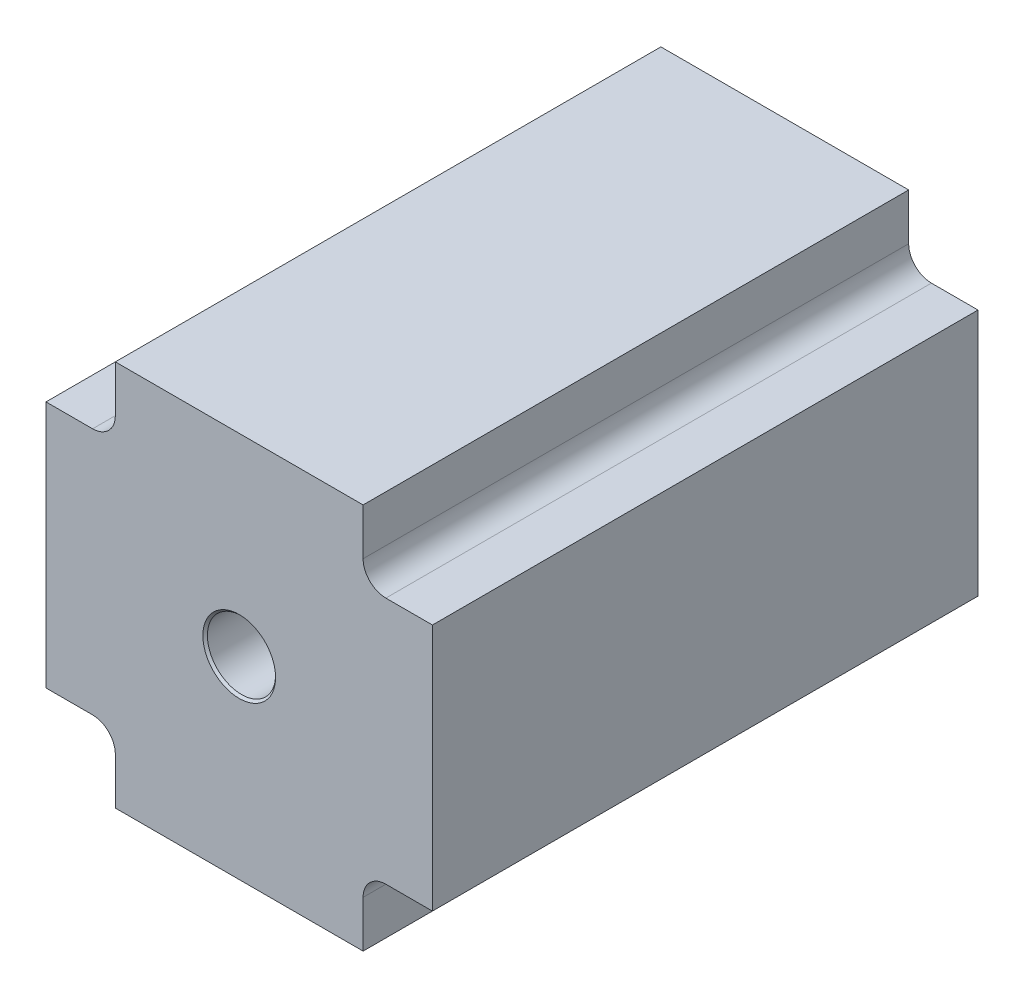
ISO-10303-21;
HEADER;
FILE_DESCRIPTION(('STEP AP214'),'2;1');
FILE_NAME('part.step','',(''),(''),'','','');
FILE_SCHEMA(('AUTOMOTIVE_DESIGN { 1 0 10303 214 1 1 1 1 }'));
ENDSEC;
DATA;
#1=APPLICATION_CONTEXT('core data for automotive mechanical design processes');
#2=APPLICATION_PROTOCOL_DEFINITION('international standard','automotive_design',2000,#1);
#3=PRODUCT_CONTEXT('',#1,'mechanical');
#4=PRODUCT('Part','Part','',(#3));
#5=PRODUCT_RELATED_PRODUCT_CATEGORY('part','',(#4));
#6=PRODUCT_DEFINITION_FORMATION('','',#4);
#7=PRODUCT_DEFINITION_CONTEXT('part definition',#1,'design');
#8=PRODUCT_DEFINITION('design','',#6,#7);
#9=PRODUCT_DEFINITION_SHAPE('','',#8);
#10=(LENGTH_UNIT() NAMED_UNIT(*) SI_UNIT(.MILLI.,.METRE.));
#11=(NAMED_UNIT(*) PLANE_ANGLE_UNIT() SI_UNIT($,.RADIAN.));
#12=(NAMED_UNIT(*) SI_UNIT($,.STERADIAN.) SOLID_ANGLE_UNIT());
#13=UNCERTAINTY_MEASURE_WITH_UNIT(LENGTH_MEASURE(1.E-05),#10,'distance_accuracy_value','');
#14=(GEOMETRIC_REPRESENTATION_CONTEXT(3) GLOBAL_UNCERTAINTY_ASSIGNED_CONTEXT((#13)) GLOBAL_UNIT_ASSIGNED_CONTEXT((#10,
#11,#12)) REPRESENTATION_CONTEXT('',''));
#15=CARTESIAN_POINT('',(0.,0.,0.));
#16=DIRECTION('',(0.,0.,1.));
#17=DIRECTION('',(1.,0.,0.));
#18=AXIS2_PLACEMENT_3D('',#15,#16,#17);
#19=CARTESIAN_POINT('',(-27.25,-27.25,120.));
#20=DIRECTION('',(1.,0.,0.));
#21=DIRECTION('',(0.,1.,0.));
#22=AXIS2_PLACEMENT_3D('',#19,#20,#21);
#23=PLANE('',#22);
#24=DIRECTION('',(0.,-1.,0.));
#25=VECTOR('',#24,1.);
#26=CARTESIAN_POINT('',(-27.25,-27.25,120.));
#27=LINE('',#26,#25);
#28=CARTESIAN_POINT('',(-27.25,-32.25,120.));
#29=VERTEX_POINT('',#28);
#30=CARTESIAN_POINT('',(-27.25,-42.5,120.));
#31=VERTEX_POINT('',#30);
#32=EDGE_CURVE('E149',#29,#31,#27,.T.);
#33=ORIENTED_EDGE('',*,*,#32,.F.);
#34=DIRECTION('',(0.,0.,-1.));
#35=VECTOR('',#34,1.);
#36=CARTESIAN_POINT('',(-27.25,-32.25,0.));
#37=LINE('',#36,#35);
#38=CARTESIAN_POINT('',(-27.25,-32.25,0.));
#39=VERTEX_POINT('',#38);
#40=EDGE_CURVE('E193',#29,#39,#37,.T.);
#41=ORIENTED_EDGE('',*,*,#40,.T.);
#42=DIRECTION('',(0.,-1.,0.));
#43=VECTOR('',#42,1.);
#44=CARTESIAN_POINT('',(-27.25,-27.25,0.));
#45=LINE('',#44,#43);
#46=CARTESIAN_POINT('',(-27.25,-42.5,0.));
#47=VERTEX_POINT('',#46);
#48=EDGE_CURVE('E174',#39,#47,#45,.T.);
#49=ORIENTED_EDGE('',*,*,#48,.T.);
#50=DIRECTION('',(0.,0.,-1.));
#51=VECTOR('',#50,1.);
#52=CARTESIAN_POINT('',(-27.25,-42.5,120.));
#53=LINE('',#52,#51);
#54=EDGE_CURVE('E167',#31,#47,#53,.T.);
#55=ORIENTED_EDGE('',*,*,#54,.F.);
#56=EDGE_LOOP('',(#33,#41,#49,#55));
#57=FACE_BOUND('',#56,.T.);
#58=ADVANCED_FACE('F37',(#57),#23,.F.);
#59=CARTESIAN_POINT('',(27.25,-42.5,120.));
#60=DIRECTION('',(0.,1.,0.));
#61=DIRECTION('',(-1.,0.,0.));
#62=AXIS2_PLACEMENT_3D('',#59,#60,#61);
#63=PLANE('',#62);
#64=DIRECTION('',(1.,0.,0.));
#65=VECTOR('',#64,1.);
#66=CARTESIAN_POINT('',(27.25,-42.5,0.));
#67=LINE('',#66,#65);
#68=CARTESIAN_POINT('',(27.25,-42.5,0.));
#69=VERTEX_POINT('',#68);
#70=EDGE_CURVE('E292',#47,#69,#67,.T.);
#71=ORIENTED_EDGE('',*,*,#70,.T.);
#72=DIRECTION('',(0.,0.,-1.));
#73=VECTOR('',#72,1.);
#74=CARTESIAN_POINT('',(27.25,-42.5,120.));
#75=LINE('',#74,#73);
#76=CARTESIAN_POINT('',(27.25,-42.5,120.));
#77=VERTEX_POINT('',#76);
#78=EDGE_CURVE('E169',#77,#69,#75,.T.);
#79=ORIENTED_EDGE('',*,*,#78,.F.);
#80=DIRECTION('',(1.,0.,0.));
#81=VECTOR('',#80,1.);
#82=CARTESIAN_POINT('',(27.25,-42.5,120.));
#83=LINE('',#82,#81);
#84=EDGE_CURVE('E154',#31,#77,#83,.T.);
#85=ORIENTED_EDGE('',*,*,#84,.F.);
#86=ORIENTED_EDGE('',*,*,#54,.T.);
#87=EDGE_LOOP('',(#71,#79,#85,#86));
#88=FACE_BOUND('',#87,.T.);
#89=ADVANCED_FACE('F166',(#88),#63,.F.);
#90=CARTESIAN_POINT('',(27.25,-27.25,120.));
#91=DIRECTION('',(-1.,0.,0.));
#92=DIRECTION('',(0.,0.,1.));
#93=AXIS2_PLACEMENT_3D('',#90,#91,#92);
#94=PLANE('',#93);
#95=DIRECTION('',(0.,1.,0.));
#96=VECTOR('',#95,1.);
#97=CARTESIAN_POINT('',(27.25,-27.25,0.));
#98=LINE('',#97,#96);
#99=CARTESIAN_POINT('',(27.25,-32.25,0.));
#100=VERTEX_POINT('',#99);
#101=EDGE_CURVE('E291',#69,#100,#98,.T.);
#102=ORIENTED_EDGE('',*,*,#101,.T.);
#103=DIRECTION('',(0.,0.,-1.));
#104=VECTOR('',#103,1.);
#105=CARTESIAN_POINT('',(27.25,-32.25,120.));
#106=LINE('',#105,#104);
#107=CARTESIAN_POINT('',(27.25,-32.25,120.));
#108=VERTEX_POINT('',#107);
#109=EDGE_CURVE('E200',#100,#108,#106,.F.);
#110=ORIENTED_EDGE('',*,*,#109,.T.);
#111=DIRECTION('',(0.,1.,0.));
#112=VECTOR('',#111,1.);
#113=CARTESIAN_POINT('',(27.25,-27.25,120.));
#114=LINE('',#113,#112);
#115=EDGE_CURVE('E171',#77,#108,#114,.T.);
#116=ORIENTED_EDGE('',*,*,#115,.F.);
#117=ORIENTED_EDGE('',*,*,#78,.T.);
#118=EDGE_LOOP('',(#102,#110,#116,#117));
#119=FACE_BOUND('',#118,.T.);
#120=ADVANCED_FACE('F317',(#119),#94,.F.);
#121=CARTESIAN_POINT('',(42.5,-27.25,120.));
#122=DIRECTION('',(0.,1.,0.));
#123=DIRECTION('',(0.,0.,1.));
#124=AXIS2_PLACEMENT_3D('',#121,#122,#123);
#125=PLANE('',#124);
#126=DIRECTION('',(1.,0.,0.));
#127=VECTOR('',#126,1.);
#128=CARTESIAN_POINT('',(42.5,-27.25,120.));
#129=LINE('',#128,#127);
#130=CARTESIAN_POINT('',(32.25,-27.25,120.));
#131=VERTEX_POINT('',#130);
#132=CARTESIAN_POINT('',(42.5,-27.25,120.));
#133=VERTEX_POINT('',#132);
#134=EDGE_CURVE('E307',#131,#133,#129,.T.);
#135=ORIENTED_EDGE('',*,*,#134,.F.);
#136=DIRECTION('',(0.,0.,-1.));
#137=VECTOR('',#136,1.);
#138=CARTESIAN_POINT('',(32.25,-27.25,0.));
#139=LINE('',#138,#137);
#140=CARTESIAN_POINT('',(32.25,-27.25,0.));
#141=VERTEX_POINT('',#140);
#142=EDGE_CURVE('E197',#131,#141,#139,.T.);
#143=ORIENTED_EDGE('',*,*,#142,.T.);
#144=DIRECTION('',(1.,0.,0.));
#145=VECTOR('',#144,1.);
#146=CARTESIAN_POINT('',(42.5,-27.25,0.));
#147=LINE('',#146,#145);
#148=CARTESIAN_POINT('',(42.5,-27.25,0.));
#149=VERTEX_POINT('',#148);
#150=EDGE_CURVE('E256',#141,#149,#147,.T.);
#151=ORIENTED_EDGE('',*,*,#150,.T.);
#152=DIRECTION('',(0.,0.,-1.));
#153=VECTOR('',#152,1.);
#154=CARTESIAN_POINT('',(42.5,-27.25,120.));
#155=LINE('',#154,#153);
#156=EDGE_CURVE('E181',#133,#149,#155,.T.);
#157=ORIENTED_EDGE('',*,*,#156,.F.);
#158=EDGE_LOOP('',(#135,#143,#151,#157));
#159=FACE_BOUND('',#158,.T.);
#160=ADVANCED_FACE('F315',(#159),#125,.F.);
#161=CARTESIAN_POINT('',(42.5,-27.25,120.));
#162=DIRECTION('',(-1.,0.,0.));
#163=DIRECTION('',(0.,0.,1.));
#164=AXIS2_PLACEMENT_3D('',#161,#162,#163);
#165=PLANE('',#164);
#166=DIRECTION('',(0.,1.,0.));
#167=VECTOR('',#166,1.);
#168=CARTESIAN_POINT('',(42.5,-27.25,0.));
#169=LINE('',#168,#167);
#170=CARTESIAN_POINT('',(42.5,27.25,0.));
#171=VERTEX_POINT('',#170);
#172=EDGE_CURVE('E252',#149,#171,#169,.T.);
#173=ORIENTED_EDGE('',*,*,#172,.T.);
#174=DIRECTION('',(0.,0.,-1.));
#175=VECTOR('',#174,1.);
#176=CARTESIAN_POINT('',(42.5,27.25,120.));
#177=LINE('',#176,#175);
#178=CARTESIAN_POINT('',(42.5,27.25,120.));
#179=VERTEX_POINT('',#178);
#180=EDGE_CURVE('E251',#179,#171,#177,.T.);
#181=ORIENTED_EDGE('',*,*,#180,.F.);
#182=DIRECTION('',(0.,1.,0.));
#183=VECTOR('',#182,1.);
#184=CARTESIAN_POINT('',(42.5,-27.25,120.));
#185=LINE('',#184,#183);
#186=EDGE_CURVE('E285',#133,#179,#185,.T.);
#187=ORIENTED_EDGE('',*,*,#186,.F.);
#188=ORIENTED_EDGE('',*,*,#156,.T.);
#189=EDGE_LOOP('',(#173,#181,#187,#188));
#190=FACE_BOUND('',#189,.T.);
#191=ADVANCED_FACE('F284',(#190),#165,.F.);
#192=CARTESIAN_POINT('',(42.5,27.25,120.));
#193=DIRECTION('',(0.,-1.,0.));
#194=DIRECTION('',(1.,0.,0.));
#195=AXIS2_PLACEMENT_3D('',#192,#193,#194);
#196=PLANE('',#195);
#197=DIRECTION('',(-1.,0.,0.));
#198=VECTOR('',#197,1.);
#199=CARTESIAN_POINT('',(42.5,27.25,0.));
#200=LINE('',#199,#198);
#201=CARTESIAN_POINT('',(32.25,27.25,0.));
#202=VERTEX_POINT('',#201);
#203=EDGE_CURVE('E244',#171,#202,#200,.T.);
#204=ORIENTED_EDGE('',*,*,#203,.T.);
#205=DIRECTION('',(0.,0.,-1.));
#206=VECTOR('',#205,1.);
#207=CARTESIAN_POINT('',(32.25,27.25,120.));
#208=LINE('',#207,#206);
#209=CARTESIAN_POINT('',(32.25,27.25,120.));
#210=VERTEX_POINT('',#209);
#211=EDGE_CURVE('E205',#202,#210,#208,.F.);
#212=ORIENTED_EDGE('',*,*,#211,.T.);
#213=DIRECTION('',(-1.,0.,0.));
#214=VECTOR('',#213,1.);
#215=CARTESIAN_POINT('',(42.5,27.25,120.));
#216=LINE('',#215,#214);
#217=EDGE_CURVE('E227',#179,#210,#216,.T.);
#218=ORIENTED_EDGE('',*,*,#217,.F.);
#219=ORIENTED_EDGE('',*,*,#180,.T.);
#220=EDGE_LOOP('',(#204,#212,#218,#219));
#221=FACE_BOUND('',#220,.T.);
#222=ADVANCED_FACE('F249',(#221),#196,.F.);
#223=CARTESIAN_POINT('',(27.25,42.5,120.));
#224=DIRECTION('',(-1.,0.,0.));
#225=DIRECTION('',(0.,-1.,0.));
#226=AXIS2_PLACEMENT_3D('',#223,#224,#225);
#227=PLANE('',#226);
#228=DIRECTION('',(0.,1.,0.));
#229=VECTOR('',#228,1.);
#230=CARTESIAN_POINT('',(27.25,42.5,120.));
#231=LINE('',#230,#229);
#232=CARTESIAN_POINT('',(27.25,32.25,120.));
#233=VERTEX_POINT('',#232);
#234=CARTESIAN_POINT('',(27.25,42.5,120.));
#235=VERTEX_POINT('',#234);
#236=EDGE_CURVE('E224',#233,#235,#231,.T.);
#237=ORIENTED_EDGE('',*,*,#236,.F.);
#238=DIRECTION('',(0.,0.,-1.));
#239=VECTOR('',#238,1.);
#240=CARTESIAN_POINT('',(27.25,32.25,0.));
#241=LINE('',#240,#239);
#242=CARTESIAN_POINT('',(27.25,32.25,0.));
#243=VERTEX_POINT('',#242);
#244=EDGE_CURVE('E202',#233,#243,#241,.T.);
#245=ORIENTED_EDGE('',*,*,#244,.T.);
#246=DIRECTION('',(0.,1.,0.));
#247=VECTOR('',#246,1.);
#248=CARTESIAN_POINT('',(27.25,42.5,0.));
#249=LINE('',#248,#247);
#250=CARTESIAN_POINT('',(27.25,42.5,0.));
#251=VERTEX_POINT('',#250);
#252=EDGE_CURVE('E246',#243,#251,#249,.T.);
#253=ORIENTED_EDGE('',*,*,#252,.T.);
#254=DIRECTION('',(0.,0.,-1.));
#255=VECTOR('',#254,1.);
#256=CARTESIAN_POINT('',(27.25,42.5,120.));
#257=LINE('',#256,#255);
#258=EDGE_CURVE('E235',#235,#251,#257,.T.);
#259=ORIENTED_EDGE('',*,*,#258,.F.);
#260=EDGE_LOOP('',(#237,#245,#253,#259));
#261=FACE_BOUND('',#260,.T.);
#262=ADVANCED_FACE('F232',(#261),#227,.F.);
#263=CARTESIAN_POINT('',(27.25,42.5,120.));
#264=DIRECTION('',(0.,-1.,0.));
#265=DIRECTION('',(1.,0.,0.));
#266=AXIS2_PLACEMENT_3D('',#263,#264,#265);
#267=PLANE('',#266);
#268=DIRECTION('',(-1.,0.,0.));
#269=VECTOR('',#268,1.);
#270=CARTESIAN_POINT('',(27.25,42.5,0.));
#271=LINE('',#270,#269);
#272=CARTESIAN_POINT('',(-27.25,42.5,0.));
#273=VERTEX_POINT('',#272);
#274=EDGE_CURVE('E254',#251,#273,#271,.T.);
#275=ORIENTED_EDGE('',*,*,#274,.T.);
#276=DIRECTION('',(0.,0.,-1.));
#277=VECTOR('',#276,1.);
#278=CARTESIAN_POINT('',(-27.25,42.5,120.));
#279=LINE('',#278,#277);
#280=CARTESIAN_POINT('',(-27.25,42.5,120.));
#281=VERTEX_POINT('',#280);
#282=EDGE_CURVE('E276',#281,#273,#279,.T.);
#283=ORIENTED_EDGE('',*,*,#282,.F.);
#284=DIRECTION('',(-1.,0.,0.));
#285=VECTOR('',#284,1.);
#286=CARTESIAN_POINT('',(27.25,42.5,120.));
#287=LINE('',#286,#285);
#288=EDGE_CURVE('E237',#235,#281,#287,.T.);
#289=ORIENTED_EDGE('',*,*,#288,.F.);
#290=ORIENTED_EDGE('',*,*,#258,.T.);
#291=EDGE_LOOP('',(#275,#283,#289,#290));
#292=FACE_BOUND('',#291,.T.);
#293=ADVANCED_FACE('F385',(#292),#267,.F.);
#294=CARTESIAN_POINT('',(-27.25,42.5,120.));
#295=DIRECTION('',(1.,0.,0.));
#296=DIRECTION('',(0.,0.,-1.));
#297=AXIS2_PLACEMENT_3D('',#294,#295,#296);
#298=PLANE('',#297);
#299=DIRECTION('',(0.,-1.,0.));
#300=VECTOR('',#299,1.);
#301=CARTESIAN_POINT('',(-27.25,42.5,0.));
#302=LINE('',#301,#300);
#303=CARTESIAN_POINT('',(-27.25,32.25,0.));
#304=VERTEX_POINT('',#303);
#305=EDGE_CURVE('E261',#273,#304,#302,.T.);
#306=ORIENTED_EDGE('',*,*,#305,.T.);
#307=DIRECTION('',(0.,0.,-1.));
#308=VECTOR('',#307,1.);
#309=CARTESIAN_POINT('',(-27.25,32.25,120.));
#310=LINE('',#309,#308);
#311=CARTESIAN_POINT('',(-27.25,32.25,120.));
#312=VERTEX_POINT('',#311);
#313=EDGE_CURVE('E52',#304,#312,#310,.F.);
#314=ORIENTED_EDGE('',*,*,#313,.T.);
#315=DIRECTION('',(0.,-1.,0.));
#316=VECTOR('',#315,1.);
#317=CARTESIAN_POINT('',(-27.25,42.5,120.));
#318=LINE('',#317,#316);
#319=EDGE_CURVE('E302',#281,#312,#318,.T.);
#320=ORIENTED_EDGE('',*,*,#319,.F.);
#321=ORIENTED_EDGE('',*,*,#282,.T.);
#322=EDGE_LOOP('',(#306,#314,#320,#321));
#323=FACE_BOUND('',#322,.T.);
#324=ADVANCED_FACE('F382',(#323),#298,.F.);
#325=CARTESIAN_POINT('',(-27.25,27.25,120.));
#326=DIRECTION('',(0.,-1.,0.));
#327=DIRECTION('',(0.,0.,-1.));
#328=AXIS2_PLACEMENT_3D('',#325,#326,#327);
#329=PLANE('',#328);
#330=DIRECTION('',(-1.,0.,0.));
#331=VECTOR('',#330,1.);
#332=CARTESIAN_POINT('',(-27.25,27.25,120.));
#333=LINE('',#332,#331);
#334=CARTESIAN_POINT('',(-32.25,27.25,120.));
#335=VERTEX_POINT('',#334);
#336=CARTESIAN_POINT('',(-42.5,27.25,120.));
#337=VERTEX_POINT('',#336);
#338=EDGE_CURVE('E300',#335,#337,#333,.T.);
#339=ORIENTED_EDGE('',*,*,#338,.F.);
#340=DIRECTION('',(0.,0.,-1.));
#341=VECTOR('',#340,1.);
#342=CARTESIAN_POINT('',(-32.25,27.25,0.));
#343=LINE('',#342,#341);
#344=CARTESIAN_POINT('',(-32.25,27.25,0.));
#345=VERTEX_POINT('',#344);
#346=EDGE_CURVE('E207',#335,#345,#343,.T.);
#347=ORIENTED_EDGE('',*,*,#346,.T.);
#348=DIRECTION('',(-1.,0.,0.));
#349=VECTOR('',#348,1.);
#350=CARTESIAN_POINT('',(-27.25,27.25,0.));
#351=LINE('',#350,#349);
#352=CARTESIAN_POINT('',(-42.5,27.25,0.));
#353=VERTEX_POINT('',#352);
#354=EDGE_CURVE('E263',#345,#353,#351,.T.);
#355=ORIENTED_EDGE('',*,*,#354,.T.);
#356=DIRECTION('',(0.,0.,-1.));
#357=VECTOR('',#356,1.);
#358=CARTESIAN_POINT('',(-42.5,27.25,120.));
#359=LINE('',#358,#357);
#360=EDGE_CURVE('E272',#337,#353,#359,.T.);
#361=ORIENTED_EDGE('',*,*,#360,.F.);
#362=EDGE_LOOP('',(#339,#347,#355,#361));
#363=FACE_BOUND('',#362,.T.);
#364=ADVANCED_FACE('F358',(#363),#329,.F.);
#365=CARTESIAN_POINT('',(-42.5,-27.25,120.));
#366=DIRECTION('',(1.,0.,0.));
#367=DIRECTION('',(0.,0.,-1.));
#368=AXIS2_PLACEMENT_3D('',#365,#366,#367);
#369=PLANE('',#368);
#370=DIRECTION('',(0.,-1.,0.));
#371=VECTOR('',#370,1.);
#372=CARTESIAN_POINT('',(-42.5,-27.25,0.));
#373=LINE('',#372,#371);
#374=CARTESIAN_POINT('',(-42.5,-27.25,0.));
#375=VERTEX_POINT('',#374);
#376=EDGE_CURVE('E265',#353,#375,#373,.T.);
#377=ORIENTED_EDGE('',*,*,#376,.T.);
#378=DIRECTION('',(0.,0.,-1.));
#379=VECTOR('',#378,1.);
#380=CARTESIAN_POINT('',(-42.5,-27.25,120.));
#381=LINE('',#380,#379);
#382=CARTESIAN_POINT('',(-42.5,-27.25,120.));
#383=VERTEX_POINT('',#382);
#384=EDGE_CURVE('E269',#383,#375,#381,.T.);
#385=ORIENTED_EDGE('',*,*,#384,.F.);
#386=DIRECTION('',(0.,-1.,0.));
#387=VECTOR('',#386,1.);
#388=CARTESIAN_POINT('',(-42.5,-27.25,120.));
#389=LINE('',#388,#387);
#390=EDGE_CURVE('E298',#337,#383,#389,.T.);
#391=ORIENTED_EDGE('',*,*,#390,.F.);
#392=ORIENTED_EDGE('',*,*,#360,.T.);
#393=EDGE_LOOP('',(#377,#385,#391,#392));
#394=FACE_BOUND('',#393,.T.);
#395=ADVANCED_FACE('F363',(#394),#369,.F.);
#396=CARTESIAN_POINT('',(-27.25,-27.25,120.));
#397=DIRECTION('',(0.,1.,0.));
#398=DIRECTION('',(-1.,0.,0.));
#399=AXIS2_PLACEMENT_3D('',#396,#397,#398);
#400=PLANE('',#399);
#401=DIRECTION('',(1.,0.,0.));
#402=VECTOR('',#401,1.);
#403=CARTESIAN_POINT('',(-27.25,-27.25,0.));
#404=LINE('',#403,#402);
#405=CARTESIAN_POINT('',(-32.25,-27.25,0.));
#406=VERTEX_POINT('',#405);
#407=EDGE_CURVE('E162',#375,#406,#404,.T.);
#408=ORIENTED_EDGE('',*,*,#407,.T.);
#409=DIRECTION('',(0.,0.,-1.));
#410=VECTOR('',#409,1.);
#411=CARTESIAN_POINT('',(-32.25,-27.25,120.));
#412=LINE('',#411,#410);
#413=CARTESIAN_POINT('',(-32.25,-27.25,120.));
#414=VERTEX_POINT('',#413);
#415=EDGE_CURVE('E195',#406,#414,#412,.F.);
#416=ORIENTED_EDGE('',*,*,#415,.T.);
#417=DIRECTION('',(1.,0.,0.));
#418=VECTOR('',#417,1.);
#419=CARTESIAN_POINT('',(-27.25,-27.25,120.));
#420=LINE('',#419,#418);
#421=EDGE_CURVE('E273',#383,#414,#420,.T.);
#422=ORIENTED_EDGE('',*,*,#421,.F.);
#423=ORIENTED_EDGE('',*,*,#384,.T.);
#424=EDGE_LOOP('',(#408,#416,#422,#423));
#425=FACE_BOUND('',#424,.T.);
#426=ADVANCED_FACE('F368',(#425),#400,.F.);
#427=CARTESIAN_POINT('',(0.,0.,120.));
#428=DIRECTION('',(0.,0.,-1.));
#429=DIRECTION('',(-1.,0.,0.));
#430=AXIS2_PLACEMENT_3D('',#427,#428,#429);
#431=PLANE('',#430);
#432=CARTESIAN_POINT('',(0.,0.,120.));
#433=DIRECTION('',(0.,0.,-1.));
#434=DIRECTION('',(-1.,0.,0.));
#435=AXIS2_PLACEMENT_3D('',#432,#433,#434);
#436=CIRCLE('',#435,8.00000000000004);
#437=CARTESIAN_POINT('',(-8.00000000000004,0.,120.));
#438=VERTEX_POINT('',#437);
#439=EDGE_CURVE('E190',#438,#438,#436,.T.);
#440=ORIENTED_EDGE('',*,*,#439,.T.);
#441=EDGE_LOOP('',(#440));
#442=FACE_BOUND('',#441,.T.);
#443=ORIENTED_EDGE('',*,*,#421,.T.);
#444=CARTESIAN_POINT('',(-32.25,-32.25,120.));
#445=DIRECTION('',(0.,0.,-1.));
#446=DIRECTION('',(-1.,0.,0.));
#447=AXIS2_PLACEMENT_3D('',#444,#445,#446);
#448=CIRCLE('',#447,5.);
#449=EDGE_CURVE('E157',#414,#29,#448,.T.);
#450=ORIENTED_EDGE('',*,*,#449,.T.);
#451=ORIENTED_EDGE('',*,*,#32,.T.);
#452=ORIENTED_EDGE('',*,*,#84,.T.);
#453=ORIENTED_EDGE('',*,*,#115,.T.);
#454=CARTESIAN_POINT('',(32.25,-32.25,120.));
#455=DIRECTION('',(0.,0.,-1.));
#456=DIRECTION('',(-1.,0.,0.));
#457=AXIS2_PLACEMENT_3D('',#454,#455,#456);
#458=CIRCLE('',#457,5.);
#459=EDGE_CURVE('E216',#108,#131,#458,.T.);
#460=ORIENTED_EDGE('',*,*,#459,.T.);
#461=ORIENTED_EDGE('',*,*,#134,.T.);
#462=ORIENTED_EDGE('',*,*,#186,.T.);
#463=ORIENTED_EDGE('',*,*,#217,.T.);
#464=CARTESIAN_POINT('',(32.25,32.25,120.));
#465=DIRECTION('',(0.,0.,-1.));
#466=DIRECTION('',(-1.,0.,0.));
#467=AXIS2_PLACEMENT_3D('',#464,#465,#466);
#468=CIRCLE('',#467,5.);
#469=EDGE_CURVE('E220',#210,#233,#468,.T.);
#470=ORIENTED_EDGE('',*,*,#469,.T.);
#471=ORIENTED_EDGE('',*,*,#236,.T.);
#472=ORIENTED_EDGE('',*,*,#288,.T.);
#473=ORIENTED_EDGE('',*,*,#319,.T.);
#474=CARTESIAN_POINT('',(-32.25,32.25,120.));
#475=DIRECTION('',(0.,0.,-1.));
#476=DIRECTION('',(-1.,0.,0.));
#477=AXIS2_PLACEMENT_3D('',#474,#475,#476);
#478=CIRCLE('',#477,5.);
#479=EDGE_CURVE('E11',#312,#335,#478,.T.);
#480=ORIENTED_EDGE('',*,*,#479,.T.);
#481=ORIENTED_EDGE('',*,*,#338,.T.);
#482=ORIENTED_EDGE('',*,*,#390,.T.);
#483=EDGE_LOOP('',(#443,#450,#451,#452,#453,#460,#461,#462,#463,#470,#471,#472,#473,#480,#481,#482));
#484=FACE_BOUND('',#483,.T.);
#485=ADVANCED_FACE('F152',(#442,#484),#431,.F.);
#486=CARTESIAN_POINT('',(0.,0.,0.));
#487=DIRECTION('',(0.,0.,-1.));
#488=DIRECTION('',(-1.,0.,0.));
#489=AXIS2_PLACEMENT_3D('',#486,#487,#488);
#490=PLANE('',#489);
#491=CARTESIAN_POINT('',(0.,0.,0.));
#492=DIRECTION('',(0.,0.,-1.));
#493=DIRECTION('',(-1.,0.,0.));
#494=AXIS2_PLACEMENT_3D('',#491,#492,#493);
#495=CIRCLE('',#494,7.99999999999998);
#496=CARTESIAN_POINT('',(-7.99999999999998,0.,0.));
#497=VERTEX_POINT('',#496);
#498=EDGE_CURVE('E176',#497,#497,#495,.F.);
#499=ORIENTED_EDGE('',*,*,#498,.T.);
#500=EDGE_LOOP('',(#499));
#501=FACE_BOUND('',#500,.T.);
#502=ORIENTED_EDGE('',*,*,#48,.F.);
#503=CARTESIAN_POINT('',(-32.25,-32.25,0.));
#504=DIRECTION('',(0.,0.,-1.));
#505=DIRECTION('',(-1.,0.,0.));
#506=AXIS2_PLACEMENT_3D('',#503,#504,#505);
#507=CIRCLE('',#506,5.);
#508=EDGE_CURVE('E211',#39,#406,#507,.F.);
#509=ORIENTED_EDGE('',*,*,#508,.T.);
#510=ORIENTED_EDGE('',*,*,#407,.F.);
#511=ORIENTED_EDGE('',*,*,#376,.F.);
#512=ORIENTED_EDGE('',*,*,#354,.F.);
#513=CARTESIAN_POINT('',(-32.25,32.25,0.));
#514=DIRECTION('',(0.,0.,-1.));
#515=DIRECTION('',(-1.,0.,0.));
#516=AXIS2_PLACEMENT_3D('',#513,#514,#515);
#517=CIRCLE('',#516,5.);
#518=EDGE_CURVE('E45',#345,#304,#517,.F.);
#519=ORIENTED_EDGE('',*,*,#518,.T.);
#520=ORIENTED_EDGE('',*,*,#305,.F.);
#521=ORIENTED_EDGE('',*,*,#274,.F.);
#522=ORIENTED_EDGE('',*,*,#252,.F.);
#523=CARTESIAN_POINT('',(32.25,32.25,0.));
#524=DIRECTION('',(0.,0.,-1.));
#525=DIRECTION('',(-1.,0.,0.));
#526=AXIS2_PLACEMENT_3D('',#523,#524,#525);
#527=CIRCLE('',#526,5.);
#528=EDGE_CURVE('E218',#243,#202,#527,.F.);
#529=ORIENTED_EDGE('',*,*,#528,.T.);
#530=ORIENTED_EDGE('',*,*,#203,.F.);
#531=ORIENTED_EDGE('',*,*,#172,.F.);
#532=ORIENTED_EDGE('',*,*,#150,.F.);
#533=CARTESIAN_POINT('',(32.25,-32.25,0.));
#534=DIRECTION('',(0.,0.,-1.));
#535=DIRECTION('',(-1.,0.,0.));
#536=AXIS2_PLACEMENT_3D('',#533,#534,#535);
#537=CIRCLE('',#536,5.);
#538=EDGE_CURVE('E214',#141,#100,#537,.F.);
#539=ORIENTED_EDGE('',*,*,#538,.T.);
#540=ORIENTED_EDGE('',*,*,#101,.F.);
#541=ORIENTED_EDGE('',*,*,#70,.F.);
#542=EDGE_LOOP('',(#502,#509,#510,#511,#512,#519,#520,#521,#522,#529,#530,#531,#532,#539,#540,#541));
#543=FACE_BOUND('',#542,.T.);
#544=ADVANCED_FACE('F242',(#501,#543),#490,.T.);
#545=CARTESIAN_POINT('',(0.,0.,0.));
#546=DIRECTION('',(0.,0.,1.));
#547=DIRECTION('',(1.,0.,0.));
#548=AXIS2_PLACEMENT_3D('',#545,#546,#547);
#549=CYLINDRICAL_SURFACE('',#548,7.5);
#550=CARTESIAN_POINT('',(0.,0.,0.499999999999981));
#551=DIRECTION('',(0.,0.,-1.));
#552=DIRECTION('',(-1.,0.,0.));
#553=AXIS2_PLACEMENT_3D('',#550,#551,#552);
#554=CIRCLE('',#553,7.5);
#555=CARTESIAN_POINT('',(-7.5,0.,0.499999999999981));
#556=VERTEX_POINT('',#555);
#557=EDGE_CURVE('E187',#556,#556,#554,.T.);
#558=ORIENTED_EDGE('',*,*,#557,.T.);
#559=EDGE_LOOP('',(#558));
#560=FACE_BOUND('',#559,.T.);
#561=CARTESIAN_POINT('',(0.,0.,119.5));
#562=DIRECTION('',(0.,0.,-1.));
#563=DIRECTION('',(-1.,0.,0.));
#564=AXIS2_PLACEMENT_3D('',#561,#562,#563);
#565=CIRCLE('',#564,7.5);
#566=CARTESIAN_POINT('',(-7.5,0.,119.5));
#567=VERTEX_POINT('',#566);
#568=EDGE_CURVE('E179',#567,#567,#565,.F.);
#569=ORIENTED_EDGE('',*,*,#568,.T.);
#570=EDGE_LOOP('',(#569));
#571=FACE_BOUND('',#570,.T.);
#572=ADVANCED_FACE('F336',(#560,#571),#549,.F.);
#573=CARTESIAN_POINT('',(0.,0.,0.));
#574=DIRECTION('',(0.,0.,-1.));
#575=DIRECTION('',(-1.,0.,0.));
#576=AXIS2_PLACEMENT_3D('',#573,#574,#575);
#577=CONICAL_SURFACE('',#576,7.99999999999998,0.785398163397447);
#578=ORIENTED_EDGE('',*,*,#557,.F.);
#579=EDGE_LOOP('',(#578));
#580=FACE_BOUND('',#579,.T.);
#581=ORIENTED_EDGE('',*,*,#498,.F.);
#582=EDGE_LOOP('',(#581));
#583=FACE_BOUND('',#582,.T.);
#584=ADVANCED_FACE('F332',(#580,#583),#577,.F.);
#585=CARTESIAN_POINT('',(0.,0.,119.5));
#586=DIRECTION('',(0.,0.,1.));
#587=DIRECTION('',(1.,0.,0.));
#588=AXIS2_PLACEMENT_3D('',#585,#586,#587);
#589=CONICAL_SURFACE('',#588,7.5,0.785398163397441);
#590=ORIENTED_EDGE('',*,*,#439,.F.);
#591=EDGE_LOOP('',(#590));
#592=FACE_BOUND('',#591,.T.);
#593=ORIENTED_EDGE('',*,*,#568,.F.);
#594=EDGE_LOOP('',(#593));
#595=FACE_BOUND('',#594,.T.);
#596=ADVANCED_FACE('F335',(#592,#595),#589,.F.);
#597=CARTESIAN_POINT('',(-32.25,-32.25,120.));
#598=DIRECTION('',(0.,0.,1.));
#599=DIRECTION('',(1.,0.,0.));
#600=AXIS2_PLACEMENT_3D('',#597,#598,#599);
#601=CYLINDRICAL_SURFACE('',#600,5.);
#602=ORIENTED_EDGE('',*,*,#449,.F.);
#603=ORIENTED_EDGE('',*,*,#415,.F.);
#604=ORIENTED_EDGE('',*,*,#508,.F.);
#605=ORIENTED_EDGE('',*,*,#40,.F.);
#606=EDGE_LOOP('',(#602,#603,#604,#605));
#607=FACE_BOUND('',#606,.T.);
#608=ADVANCED_FACE('F340',(#607),#601,.F.);
#609=CARTESIAN_POINT('',(32.25,-32.25,120.));
#610=DIRECTION('',(0.,0.,1.));
#611=DIRECTION('',(1.,0.,0.));
#612=AXIS2_PLACEMENT_3D('',#609,#610,#611);
#613=CYLINDRICAL_SURFACE('',#612,5.);
#614=ORIENTED_EDGE('',*,*,#459,.F.);
#615=ORIENTED_EDGE('',*,*,#109,.F.);
#616=ORIENTED_EDGE('',*,*,#538,.F.);
#617=ORIENTED_EDGE('',*,*,#142,.F.);
#618=EDGE_LOOP('',(#614,#615,#616,#617));
#619=FACE_BOUND('',#618,.T.);
#620=ADVANCED_FACE('F314',(#619),#613,.F.);
#621=CARTESIAN_POINT('',(32.25,32.25,120.));
#622=DIRECTION('',(0.,0.,1.));
#623=DIRECTION('',(1.,0.,0.));
#624=AXIS2_PLACEMENT_3D('',#621,#622,#623);
#625=CYLINDRICAL_SURFACE('',#624,5.);
#626=ORIENTED_EDGE('',*,*,#469,.F.);
#627=ORIENTED_EDGE('',*,*,#211,.F.);
#628=ORIENTED_EDGE('',*,*,#528,.F.);
#629=ORIENTED_EDGE('',*,*,#244,.F.);
#630=EDGE_LOOP('',(#626,#627,#628,#629));
#631=FACE_BOUND('',#630,.T.);
#632=ADVANCED_FACE('F239',(#631),#625,.F.);
#633=CARTESIAN_POINT('',(-32.25,32.25,120.));
#634=DIRECTION('',(0.,0.,1.));
#635=DIRECTION('',(1.,0.,0.));
#636=AXIS2_PLACEMENT_3D('',#633,#634,#635);
#637=CYLINDRICAL_SURFACE('',#636,5.);
#638=ORIENTED_EDGE('',*,*,#479,.F.);
#639=ORIENTED_EDGE('',*,*,#313,.F.);
#640=ORIENTED_EDGE('',*,*,#518,.F.);
#641=ORIENTED_EDGE('',*,*,#346,.F.);
#642=EDGE_LOOP('',(#638,#639,#640,#641));
#643=FACE_BOUND('',#642,.T.);
#644=ADVANCED_FACE('F39',(#643),#637,.F.);
#645=CLOSED_SHELL('',(#58,#89,#120,#160,#191,#222,#262,#293,#324,#364,#395,#426,#485,#544,#572,
#584,#596,#608,#620,#632,#644));
#646=MANIFOLD_SOLID_BREP('B2',#645);
#647=ADVANCED_BREP_SHAPE_REPRESENTATION('',(#18,#646),#14);
#648=SHAPE_DEFINITION_REPRESENTATION(#9,#647);
ENDSEC;
END-ISO-10303-21;
